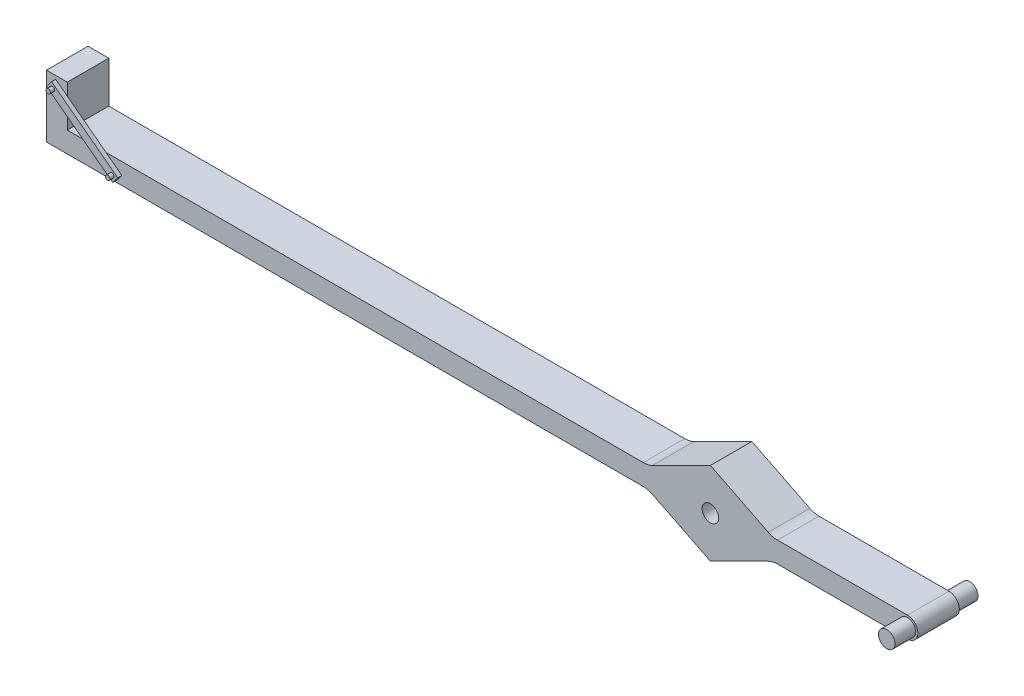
ISO-10303-21;
HEADER;
FILE_DESCRIPTION(('STEP AP214'),'2;1');
FILE_NAME('part.step','',(''),(''),'','','');
FILE_SCHEMA(('AUTOMOTIVE_DESIGN { 1 0 10303 214 1 1 1 1 }'));
ENDSEC;
DATA;
#1=APPLICATION_CONTEXT('core data for automotive mechanical design processes');
#2=APPLICATION_PROTOCOL_DEFINITION('international standard','automotive_design',2000,#1);
#3=PRODUCT_CONTEXT('',#1,'mechanical');
#4=PRODUCT('Part','Part','',(#3));
#5=PRODUCT_RELATED_PRODUCT_CATEGORY('part','',(#4));
#6=PRODUCT_DEFINITION_FORMATION('','',#4);
#7=PRODUCT_DEFINITION_CONTEXT('part definition',#1,'design');
#8=PRODUCT_DEFINITION('design','',#6,#7);
#9=PRODUCT_DEFINITION_SHAPE('','',#8);
#10=(LENGTH_UNIT() NAMED_UNIT(*) SI_UNIT(.MILLI.,.METRE.));
#11=(NAMED_UNIT(*) PLANE_ANGLE_UNIT() SI_UNIT($,.RADIAN.));
#12=(NAMED_UNIT(*) SI_UNIT($,.STERADIAN.) SOLID_ANGLE_UNIT());
#13=UNCERTAINTY_MEASURE_WITH_UNIT(LENGTH_MEASURE(1.E-05),#10,'distance_accuracy_value','');
#14=(GEOMETRIC_REPRESENTATION_CONTEXT(3) GLOBAL_UNCERTAINTY_ASSIGNED_CONTEXT((#13)) GLOBAL_UNIT_ASSIGNED_CONTEXT((#10,
#11,#12)) REPRESENTATION_CONTEXT('',''));
#15=CARTESIAN_POINT('',(0.,0.,0.));
#16=DIRECTION('',(0.,0.,1.));
#17=DIRECTION('',(1.,0.,0.));
#18=AXIS2_PLACEMENT_3D('',#15,#16,#17);
#19=CARTESIAN_POINT('',(-160.,-2.50000000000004,5.));
#20=DIRECTION('',(0.,0.,1.));
#21=DIRECTION('',(1.,0.,0.));
#22=AXIS2_PLACEMENT_3D('',#19,#20,#21);
#23=PLANE('',#22);
#24=CARTESIAN_POINT('',(47.5,0.,5.));
#25=DIRECTION('',(0.,0.,1.));
#26=DIRECTION('',(1.,0.,0.));
#27=AXIS2_PLACEMENT_3D('',#24,#25,#26);
#28=CIRCLE('',#27,2.);
#29=CARTESIAN_POINT('',(49.5,0.,5.));
#30=VERTEX_POINT('',#29);
#31=EDGE_CURVE('E11',#30,#30,#28,.T.);
#32=ORIENTED_EDGE('',*,*,#31,.F.);
#33=EDGE_LOOP('',(#32));
#34=FACE_BOUND('',#33,.T.);
#35=CARTESIAN_POINT('',(0.,0.,5.));
#36=DIRECTION('',(0.,0.,1.));
#37=DIRECTION('',(1.,0.,0.));
#38=AXIS2_PLACEMENT_3D('',#35,#36,#37);
#39=CIRCLE('',#38,2.);
#40=CARTESIAN_POINT('',(2.,0.,5.));
#41=VERTEX_POINT('',#40);
#42=EDGE_CURVE('E265',#41,#41,#39,.T.);
#43=ORIENTED_EDGE('',*,*,#42,.F.);
#44=EDGE_LOOP('',(#43));
#45=FACE_BOUND('',#44,.T.);
#46=DIRECTION('',(0.604197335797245,0.79683472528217,0.));
#47=VECTOR('',#46,1.);
#48=CARTESIAN_POINT('',(-141.84738728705,-0.390268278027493,5.));
#49=LINE('',#48,#47);
#50=CARTESIAN_POINT('',(-143.055781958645,-1.98393772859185,5.));
#51=VERTEX_POINT('',#50);
#52=CARTESIAN_POINT('',(-141.84738728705,-0.390268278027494,5.));
#53=VERTEX_POINT('',#52);
#54=EDGE_CURVE('E53',#51,#53,#49,.T.);
#55=ORIENTED_EDGE('',*,*,#54,.F.);
#56=DIRECTION('',(0.79683472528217,-0.604197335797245,0.));
#57=VECTOR('',#56,1.);
#58=CARTESIAN_POINT('',(-143.055781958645,-1.98393772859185,5.));
#59=LINE('',#58,#57);
#60=CARTESIAN_POINT('',(-148.96934210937,2.5,5.));
#61=VERTEX_POINT('',#60);
#62=EDGE_CURVE('E240',#61,#51,#59,.T.);
#63=ORIENTED_EDGE('',*,*,#62,.F.);
#64=DIRECTION('',(-1.,0.,0.));
#65=VECTOR('',#64,1.);
#66=CARTESIAN_POINT('',(-160.,2.5,5.));
#67=LINE('',#66,#65);
#68=CARTESIAN_POINT('',(-155.,2.5,5.));
#69=VERTEX_POINT('',#68);
#70=EDGE_CURVE('E293',#61,#69,#67,.T.);
#71=ORIENTED_EDGE('',*,*,#70,.T.);
#72=DIRECTION('',(0.,-1.,0.));
#73=VECTOR('',#72,1.);
#74=CARTESIAN_POINT('',(-155.,2.5,5.));
#75=LINE('',#74,#73);
#76=CARTESIAN_POINT('',(-155.,7.07272670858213,5.));
#77=VERTEX_POINT('',#76);
#78=EDGE_CURVE('E200',#77,#69,#75,.T.);
#79=ORIENTED_EDGE('',*,*,#78,.F.);
#80=CARTESIAN_POINT('',(-158.992476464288,10.1000089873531,5.));
#81=VERTEX_POINT('',#80);
#82=EDGE_CURVE('E241',#81,#77,#59,.T.);
#83=ORIENTED_EDGE('',*,*,#82,.F.);
#84=DIRECTION('',(-0.604197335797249,-0.796834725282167,0.));
#85=VECTOR('',#84,1.);
#86=CARTESIAN_POINT('',(-158.992476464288,10.1000089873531,5.));
#87=LINE('',#86,#85);
#88=CARTESIAN_POINT('',(-157.784081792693,11.6936784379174,5.));
#89=VERTEX_POINT('',#88);
#90=EDGE_CURVE('E227',#89,#81,#87,.T.);
#91=ORIENTED_EDGE('',*,*,#90,.F.);
#92=DIRECTION('',(-0.79683472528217,0.604197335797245,0.));
#93=VECTOR('',#92,1.);
#94=CARTESIAN_POINT('',(-157.784081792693,11.6936784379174,5.));
#95=LINE('',#94,#93);
#96=CARTESIAN_POINT('',(-155.,9.58265748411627,5.));
#97=VERTEX_POINT('',#96);
#98=EDGE_CURVE('E193',#97,#89,#95,.T.);
#99=ORIENTED_EDGE('',*,*,#98,.F.);
#100=CARTESIAN_POINT('',(-155.,12.5,5.));
#101=VERTEX_POINT('',#100);
#102=EDGE_CURVE('E186',#101,#97,#75,.T.);
#103=ORIENTED_EDGE('',*,*,#102,.F.);
#104=DIRECTION('',(1.,0.,0.));
#105=VECTOR('',#104,1.);
#106=CARTESIAN_POINT('',(-160.,12.5,5.));
#107=LINE('',#106,#105);
#108=CARTESIAN_POINT('',(-160.,12.5,5.));
#109=VERTEX_POINT('',#108);
#110=EDGE_CURVE('E190',#109,#101,#107,.T.);
#111=ORIENTED_EDGE('',*,*,#110,.F.);
#112=DIRECTION('',(0.,-1.,0.));
#113=VECTOR('',#112,1.);
#114=CARTESIAN_POINT('',(-160.,2.5,5.));
#115=LINE('',#114,#113);
#116=CARTESIAN_POINT('',(-160.,-2.50000000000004,5.));
#117=VERTEX_POINT('',#116);
#118=EDGE_CURVE('E272',#109,#117,#115,.T.);
#119=ORIENTED_EDGE('',*,*,#118,.T.);
#120=DIRECTION('',(1.,0.,0.));
#121=VECTOR('',#120,1.);
#122=CARTESIAN_POINT('',(-160.,-2.50000000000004,5.));
#123=LINE('',#122,#121);
#124=CARTESIAN_POINT('',(-16.180339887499,-2.5,5.));
#125=VERTEX_POINT('',#124);
#126=EDGE_CURVE('E274',#117,#125,#123,.T.);
#127=ORIENTED_EDGE('',*,*,#126,.T.);
#128=CARTESIAN_POINT('',(-16.1803398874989,-7.50000000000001,5.));
#129=DIRECTION('',(0.,0.,1.));
#130=DIRECTION('',(1.,0.,0.));
#131=AXIS2_PLACEMENT_3D('',#128,#129,#130);
#132=CIRCLE('',#131,5.);
#133=CARTESIAN_POINT('',(-13.9442719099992,-3.02786404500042,5.));
#134=VERTEX_POINT('',#133);
#135=EDGE_CURVE('E360',#125,#134,#132,.F.);
#136=ORIENTED_EDGE('',*,*,#135,.T.);
#137=DIRECTION('',(0.894427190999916,-0.447213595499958,0.));
#138=VECTOR('',#137,1.);
#139=CARTESIAN_POINT('',(-15.,-2.5,5.));
#140=LINE('',#139,#138);
#141=CARTESIAN_POINT('',(0.,-10.,5.));
#142=VERTEX_POINT('',#141);
#143=EDGE_CURVE('E278',#134,#142,#140,.T.);
#144=ORIENTED_EDGE('',*,*,#143,.T.);
#145=DIRECTION('',(0.894427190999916,0.447213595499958,0.));
#146=VECTOR('',#145,1.);
#147=CARTESIAN_POINT('',(0.,-10.,5.));
#148=LINE('',#147,#146);
#149=CARTESIAN_POINT('',(13.9442719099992,-3.02786404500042,5.));
#150=VERTEX_POINT('',#149);
#151=EDGE_CURVE('E280',#142,#150,#148,.T.);
#152=ORIENTED_EDGE('',*,*,#151,.T.);
#153=CARTESIAN_POINT('',(16.180339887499,-7.5,5.));
#154=DIRECTION('',(0.,0.,1.));
#155=DIRECTION('',(1.,0.,0.));
#156=AXIS2_PLACEMENT_3D('',#153,#154,#155);
#157=CIRCLE('',#156,5.);
#158=CARTESIAN_POINT('',(16.180339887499,-2.5,5.));
#159=VERTEX_POINT('',#158);
#160=EDGE_CURVE('E356',#150,#159,#157,.F.);
#161=ORIENTED_EDGE('',*,*,#160,.T.);
#162=DIRECTION('',(1.,0.,0.));
#163=VECTOR('',#162,1.);
#164=CARTESIAN_POINT('',(15.,-2.5,5.));
#165=LINE('',#164,#163);
#166=CARTESIAN_POINT('',(47.5,-2.49999999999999,5.));
#167=VERTEX_POINT('',#166);
#168=EDGE_CURVE('E283',#159,#167,#165,.T.);
#169=ORIENTED_EDGE('',*,*,#168,.T.);
#170=CARTESIAN_POINT('',(47.5,0.,5.));
#171=DIRECTION('',(0.,0.,1.));
#172=DIRECTION('',(1.,0.,0.));
#173=AXIS2_PLACEMENT_3D('',#170,#171,#172);
#174=CIRCLE('',#173,2.49999999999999);
#175=CARTESIAN_POINT('',(47.5,2.5,5.));
#176=VERTEX_POINT('',#175);
#177=EDGE_CURVE('E372',#167,#176,#174,.T.);
#178=ORIENTED_EDGE('',*,*,#177,.T.);
#179=DIRECTION('',(-1.,0.,0.));
#180=VECTOR('',#179,1.);
#181=CARTESIAN_POINT('',(15.,2.5,5.));
#182=LINE('',#181,#180);
#183=CARTESIAN_POINT('',(16.1803398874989,2.5,5.));
#184=VERTEX_POINT('',#183);
#185=EDGE_CURVE('E286',#176,#184,#182,.T.);
#186=ORIENTED_EDGE('',*,*,#185,.T.);
#187=CARTESIAN_POINT('',(16.1803398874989,7.5,5.));
#188=DIRECTION('',(0.,0.,1.));
#189=DIRECTION('',(1.,0.,0.));
#190=AXIS2_PLACEMENT_3D('',#187,#188,#189);
#191=CIRCLE('',#190,5.);
#192=CARTESIAN_POINT('',(13.9442719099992,3.02786404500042,5.));
#193=VERTEX_POINT('',#192);
#194=EDGE_CURVE('E352',#184,#193,#191,.F.);
#195=ORIENTED_EDGE('',*,*,#194,.T.);
#196=DIRECTION('',(-0.894427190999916,0.447213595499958,0.));
#197=VECTOR('',#196,1.);
#198=CARTESIAN_POINT('',(0.,10.,5.));
#199=LINE('',#198,#197);
#200=CARTESIAN_POINT('',(0.,10.,5.));
#201=VERTEX_POINT('',#200);
#202=EDGE_CURVE('E288',#193,#201,#199,.T.);
#203=ORIENTED_EDGE('',*,*,#202,.T.);
#204=DIRECTION('',(-0.894427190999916,-0.447213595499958,0.));
#205=VECTOR('',#204,1.);
#206=CARTESIAN_POINT('',(-15.,2.5,5.));
#207=LINE('',#206,#205);
#208=CARTESIAN_POINT('',(-13.9442719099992,3.02786404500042,5.));
#209=VERTEX_POINT('',#208);
#210=EDGE_CURVE('E290',#201,#209,#207,.T.);
#211=ORIENTED_EDGE('',*,*,#210,.T.);
#212=CARTESIAN_POINT('',(-16.180339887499,7.5,5.));
#213=DIRECTION('',(0.,0.,1.));
#214=DIRECTION('',(1.,0.,0.));
#215=AXIS2_PLACEMENT_3D('',#212,#213,#214);
#216=CIRCLE('',#215,5.);
#217=CARTESIAN_POINT('',(-16.180339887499,2.5,5.));
#218=VERTEX_POINT('',#217);
#219=EDGE_CURVE('E364',#209,#218,#216,.F.);
#220=ORIENTED_EDGE('',*,*,#219,.T.);
#221=CARTESIAN_POINT('',(-145.659165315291,2.5,5.));
#222=VERTEX_POINT('',#221);
#223=EDGE_CURVE('E294',#218,#222,#67,.T.);
#224=ORIENTED_EDGE('',*,*,#223,.T.);
#225=DIRECTION('',(-0.79683472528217,0.604197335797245,0.));
#226=VECTOR('',#225,1.);
#227=CARTESIAN_POINT('',(-157.784081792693,11.6936784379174,5.));
#228=LINE('',#227,#226);
#229=EDGE_CURVE('E58',#53,#222,#228,.T.);
#230=ORIENTED_EDGE('',*,*,#229,.F.);
#231=EDGE_LOOP('',(#55,#63,#71,#79,#83,#91,#99,#103,#111,#119,#127,#136,#144,#152,#161,#169,
#178,#186,#195,#203,#211,#220,#224,#230));
#232=FACE_BOUND('',#231,.T.);
#233=ADVANCED_FACE('F36',(#34,#45,#232),#23,.T.);
#234=CARTESIAN_POINT('',(47.5,0.,5.));
#235=DIRECTION('',(0.,0.,-1.));
#236=DIRECTION('',(-1.,0.,0.));
#237=AXIS2_PLACEMENT_3D('',#234,#235,#236);
#238=CYLINDRICAL_SURFACE('',#237,2.49999999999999);
#239=DIRECTION('',(0.,0.,-1.));
#240=VECTOR('',#239,1.);
#241=CARTESIAN_POINT('',(47.5,2.5,5.));
#242=LINE('',#241,#240);
#243=CARTESIAN_POINT('',(47.5,2.5,-5.));
#244=VERTEX_POINT('',#243);
#245=EDGE_CURVE('E366',#176,#244,#242,.T.);
#246=ORIENTED_EDGE('',*,*,#245,.F.);
#247=ORIENTED_EDGE('',*,*,#177,.F.);
#248=DIRECTION('',(0.,0.,-1.));
#249=VECTOR('',#248,1.);
#250=CARTESIAN_POINT('',(47.5,-2.49999999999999,5.));
#251=LINE('',#250,#249);
#252=CARTESIAN_POINT('',(47.5,-2.49999999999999,-5.));
#253=VERTEX_POINT('',#252);
#254=EDGE_CURVE('E369',#253,#167,#251,.F.);
#255=ORIENTED_EDGE('',*,*,#254,.F.);
#256=CARTESIAN_POINT('',(47.5,0.,-5.));
#257=DIRECTION('',(0.,0.,1.));
#258=DIRECTION('',(1.,0.,0.));
#259=AXIS2_PLACEMENT_3D('',#256,#257,#258);
#260=CIRCLE('',#259,2.49999999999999);
#261=EDGE_CURVE('E45',#244,#253,#260,.F.);
#262=ORIENTED_EDGE('',*,*,#261,.F.);
#263=EDGE_LOOP('',(#246,#247,#255,#262));
#264=FACE_BOUND('',#263,.T.);
#265=ADVANCED_FACE('F38',(#264),#238,.T.);
#266=CARTESIAN_POINT('',(-160.,-2.50000000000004,-5.));
#267=DIRECTION('',(0.,0.,1.));
#268=DIRECTION('',(1.,0.,0.));
#269=AXIS2_PLACEMENT_3D('',#266,#267,#268);
#270=PLANE('',#269);
#271=CARTESIAN_POINT('',(47.5,0.,-5.));
#272=DIRECTION('',(0.,0.,1.));
#273=DIRECTION('',(1.,0.,0.));
#274=AXIS2_PLACEMENT_3D('',#271,#272,#273);
#275=CIRCLE('',#274,2.);
#276=CARTESIAN_POINT('',(49.5,0.,-5.));
#277=VERTEX_POINT('',#276);
#278=EDGE_CURVE('E40',#277,#277,#275,.T.);
#279=ORIENTED_EDGE('',*,*,#278,.T.);
#280=EDGE_LOOP('',(#279));
#281=FACE_BOUND('',#280,.T.);
#282=DIRECTION('',(-1.,0.,0.));
#283=VECTOR('',#282,1.);
#284=CARTESIAN_POINT('',(15.,2.5,-5.));
#285=LINE('',#284,#283);
#286=CARTESIAN_POINT('',(16.1803398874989,2.5,-5.));
#287=VERTEX_POINT('',#286);
#288=EDGE_CURVE('E311',#244,#287,#285,.T.);
#289=ORIENTED_EDGE('',*,*,#288,.F.);
#290=ORIENTED_EDGE('',*,*,#261,.T.);
#291=DIRECTION('',(1.,0.,0.));
#292=VECTOR('',#291,1.);
#293=CARTESIAN_POINT('',(15.,-2.5,-5.));
#294=LINE('',#293,#292);
#295=CARTESIAN_POINT('',(16.180339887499,-2.5,-5.));
#296=VERTEX_POINT('',#295);
#297=EDGE_CURVE('E308',#296,#253,#294,.T.);
#298=ORIENTED_EDGE('',*,*,#297,.F.);
#299=CARTESIAN_POINT('',(16.180339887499,-7.5,-5.));
#300=DIRECTION('',(0.,0.,1.));
#301=DIRECTION('',(1.,0.,0.));
#302=AXIS2_PLACEMENT_3D('',#299,#300,#301);
#303=CIRCLE('',#302,5.);
#304=CARTESIAN_POINT('',(13.9442719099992,-3.02786404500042,-5.));
#305=VERTEX_POINT('',#304);
#306=EDGE_CURVE('E354',#296,#305,#303,.T.);
#307=ORIENTED_EDGE('',*,*,#306,.T.);
#308=DIRECTION('',(0.894427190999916,0.447213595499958,0.));
#309=VECTOR('',#308,1.);
#310=CARTESIAN_POINT('',(0.,-10.,-5.));
#311=LINE('',#310,#309);
#312=CARTESIAN_POINT('',(0.,-10.,-5.));
#313=VERTEX_POINT('',#312);
#314=EDGE_CURVE('E305',#313,#305,#311,.T.);
#315=ORIENTED_EDGE('',*,*,#314,.F.);
#316=DIRECTION('',(0.894427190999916,-0.447213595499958,0.));
#317=VECTOR('',#316,1.);
#318=CARTESIAN_POINT('',(-15.,-2.5,-5.));
#319=LINE('',#318,#317);
#320=CARTESIAN_POINT('',(-13.9442719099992,-3.02786404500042,-5.));
#321=VERTEX_POINT('',#320);
#322=EDGE_CURVE('E303',#321,#313,#319,.T.);
#323=ORIENTED_EDGE('',*,*,#322,.F.);
#324=CARTESIAN_POINT('',(-16.1803398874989,-7.50000000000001,-5.));
#325=DIRECTION('',(0.,0.,1.));
#326=DIRECTION('',(1.,0.,0.));
#327=AXIS2_PLACEMENT_3D('',#324,#325,#326);
#328=CIRCLE('',#327,5.);
#329=CARTESIAN_POINT('',(-16.180339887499,-2.5,-5.));
#330=VERTEX_POINT('',#329);
#331=EDGE_CURVE('E358',#321,#330,#328,.T.);
#332=ORIENTED_EDGE('',*,*,#331,.T.);
#333=DIRECTION('',(1.,0.,0.));
#334=VECTOR('',#333,1.);
#335=CARTESIAN_POINT('',(-160.,-2.50000000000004,-5.));
#336=LINE('',#335,#334);
#337=CARTESIAN_POINT('',(-160.,-2.50000000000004,-5.));
#338=VERTEX_POINT('',#337);
#339=EDGE_CURVE('E300',#338,#330,#336,.T.);
#340=ORIENTED_EDGE('',*,*,#339,.F.);
#341=DIRECTION('',(0.,-1.,0.));
#342=VECTOR('',#341,1.);
#343=CARTESIAN_POINT('',(-160.,2.5,-5.));
#344=LINE('',#343,#342);
#345=CARTESIAN_POINT('',(-160.,12.5,-5.));
#346=VERTEX_POINT('',#345);
#347=EDGE_CURVE('E268',#346,#338,#344,.T.);
#348=ORIENTED_EDGE('',*,*,#347,.F.);
#349=DIRECTION('',(1.,0.,0.));
#350=VECTOR('',#349,1.);
#351=CARTESIAN_POINT('',(-160.,12.5,-5.));
#352=LINE('',#351,#350);
#353=CARTESIAN_POINT('',(-155.,12.5,-5.));
#354=VERTEX_POINT('',#353);
#355=EDGE_CURVE('E214',#346,#354,#352,.T.);
#356=ORIENTED_EDGE('',*,*,#355,.T.);
#357=DIRECTION('',(0.,-1.,0.));
#358=VECTOR('',#357,1.);
#359=CARTESIAN_POINT('',(-155.,2.5,-5.));
#360=LINE('',#359,#358);
#361=CARTESIAN_POINT('',(-155.,2.5,-5.));
#362=VERTEX_POINT('',#361);
#363=EDGE_CURVE('E205',#354,#362,#360,.T.);
#364=ORIENTED_EDGE('',*,*,#363,.T.);
#365=DIRECTION('',(-1.,0.,0.));
#366=VECTOR('',#365,1.);
#367=CARTESIAN_POINT('',(-160.,2.5,-5.));
#368=LINE('',#367,#366);
#369=CARTESIAN_POINT('',(-16.180339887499,2.5,-5.));
#370=VERTEX_POINT('',#369);
#371=EDGE_CURVE('E275',#370,#362,#368,.T.);
#372=ORIENTED_EDGE('',*,*,#371,.F.);
#373=CARTESIAN_POINT('',(-16.180339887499,7.5,-5.));
#374=DIRECTION('',(0.,0.,1.));
#375=DIRECTION('',(1.,0.,0.));
#376=AXIS2_PLACEMENT_3D('',#373,#374,#375);
#377=CIRCLE('',#376,5.);
#378=CARTESIAN_POINT('',(-13.9442719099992,3.02786404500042,-5.));
#379=VERTEX_POINT('',#378);
#380=EDGE_CURVE('E362',#370,#379,#377,.T.);
#381=ORIENTED_EDGE('',*,*,#380,.T.);
#382=DIRECTION('',(-0.894427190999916,-0.447213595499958,0.));
#383=VECTOR('',#382,1.);
#384=CARTESIAN_POINT('',(-15.,2.5,-5.));
#385=LINE('',#384,#383);
#386=CARTESIAN_POINT('',(0.,10.,-5.));
#387=VERTEX_POINT('',#386);
#388=EDGE_CURVE('E315',#387,#379,#385,.T.);
#389=ORIENTED_EDGE('',*,*,#388,.F.);
#390=DIRECTION('',(-0.894427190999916,0.447213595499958,0.));
#391=VECTOR('',#390,1.);
#392=CARTESIAN_POINT('',(0.,10.,-5.));
#393=LINE('',#392,#391);
#394=CARTESIAN_POINT('',(13.9442719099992,3.02786404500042,-5.));
#395=VERTEX_POINT('',#394);
#396=EDGE_CURVE('E313',#395,#387,#393,.T.);
#397=ORIENTED_EDGE('',*,*,#396,.F.);
#398=CARTESIAN_POINT('',(16.1803398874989,7.5,-5.));
#399=DIRECTION('',(0.,0.,1.));
#400=DIRECTION('',(1.,0.,0.));
#401=AXIS2_PLACEMENT_3D('',#398,#399,#400);
#402=CIRCLE('',#401,5.);
#403=EDGE_CURVE('E349',#395,#287,#402,.T.);
#404=ORIENTED_EDGE('',*,*,#403,.T.);
#405=EDGE_LOOP('',(#289,#290,#298,#307,#315,#323,#332,#340,#348,#356,#364,#372,#381,#389,#397,#404));
#406=FACE_BOUND('',#405,.T.);
#407=CARTESIAN_POINT('',(0.,0.,-5.));
#408=DIRECTION('',(0.,0.,1.));
#409=DIRECTION('',(1.,0.,0.));
#410=AXIS2_PLACEMENT_3D('',#407,#408,#409);
#411=CIRCLE('',#410,2.);
#412=CARTESIAN_POINT('',(2.,0.,-5.));
#413=VERTEX_POINT('',#412);
#414=EDGE_CURVE('E269',#413,#413,#411,.T.);
#415=ORIENTED_EDGE('',*,*,#414,.T.);
#416=EDGE_LOOP('',(#415));
#417=FACE_BOUND('',#416,.T.);
#418=ADVANCED_FACE('F377',(#281,#406,#417),#270,.F.);
#419=CARTESIAN_POINT('',(-160.,2.5,5.));
#420=DIRECTION('',(1.,0.,0.));
#421=DIRECTION('',(0.,0.,-1.));
#422=AXIS2_PLACEMENT_3D('',#419,#420,#421);
#423=PLANE('',#422);
#424=ORIENTED_EDGE('',*,*,#347,.T.);
#425=DIRECTION('',(0.,0.,-1.));
#426=VECTOR('',#425,1.);
#427=CARTESIAN_POINT('',(-160.,-2.50000000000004,5.));
#428=LINE('',#427,#426);
#429=EDGE_CURVE('E325',#117,#338,#428,.T.);
#430=ORIENTED_EDGE('',*,*,#429,.F.);
#431=ORIENTED_EDGE('',*,*,#118,.F.);
#432=DIRECTION('',(0.,0.,-1.));
#433=VECTOR('',#432,1.);
#434=CARTESIAN_POINT('',(-160.,12.5,16.180339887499));
#435=LINE('',#434,#433);
#436=EDGE_CURVE('E212',#109,#346,#435,.T.);
#437=ORIENTED_EDGE('',*,*,#436,.T.);
#438=EDGE_LOOP('',(#424,#430,#431,#437));
#439=FACE_BOUND('',#438,.T.);
#440=ADVANCED_FACE('F407',(#439),#423,.F.);
#441=CARTESIAN_POINT('',(-160.,-2.50000000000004,5.));
#442=DIRECTION('',(0.,1.,0.));
#443=DIRECTION('',(-1.,0.,0.));
#444=AXIS2_PLACEMENT_3D('',#441,#442,#443);
#445=PLANE('',#444);
#446=ORIENTED_EDGE('',*,*,#339,.T.);
#447=DIRECTION('',(0.,0.,-1.));
#448=VECTOR('',#447,1.);
#449=CARTESIAN_POINT('',(-16.1803398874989,-2.5,5.));
#450=LINE('',#449,#448);
#451=EDGE_CURVE('E342',#330,#125,#450,.F.);
#452=ORIENTED_EDGE('',*,*,#451,.T.);
#453=ORIENTED_EDGE('',*,*,#126,.F.);
#454=ORIENTED_EDGE('',*,*,#429,.T.);
#455=EDGE_LOOP('',(#446,#452,#453,#454));
#456=FACE_BOUND('',#455,.T.);
#457=ADVANCED_FACE('F402',(#456),#445,.F.);
#458=CARTESIAN_POINT('',(-15.,-2.5,5.));
#459=DIRECTION('',(0.447213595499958,0.894427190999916,0.));
#460=DIRECTION('',(-0.894427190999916,0.447213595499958,0.));
#461=AXIS2_PLACEMENT_3D('',#458,#459,#460);
#462=PLANE('',#461);
#463=ORIENTED_EDGE('',*,*,#143,.F.);
#464=DIRECTION('',(0.,0.,-1.));
#465=VECTOR('',#464,1.);
#466=CARTESIAN_POINT('',(-13.9442719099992,-3.02786404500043,-5.));
#467=LINE('',#466,#465);
#468=EDGE_CURVE('E339',#134,#321,#467,.T.);
#469=ORIENTED_EDGE('',*,*,#468,.T.);
#470=ORIENTED_EDGE('',*,*,#322,.T.);
#471=DIRECTION('',(0.,0.,-1.));
#472=VECTOR('',#471,1.);
#473=CARTESIAN_POINT('',(0.,-10.,5.));
#474=LINE('',#473,#472);
#475=EDGE_CURVE('E322',#142,#313,#474,.T.);
#476=ORIENTED_EDGE('',*,*,#475,.F.);
#477=EDGE_LOOP('',(#463,#469,#470,#476));
#478=FACE_BOUND('',#477,.T.);
#479=ADVANCED_FACE('F397',(#478),#462,.F.);
#480=CARTESIAN_POINT('',(0.,-10.,5.));
#481=DIRECTION('',(-0.447213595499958,0.894427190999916,0.));
#482=DIRECTION('',(-0.894427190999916,-0.447213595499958,0.));
#483=AXIS2_PLACEMENT_3D('',#480,#481,#482);
#484=PLANE('',#483);
#485=ORIENTED_EDGE('',*,*,#314,.T.);
#486=DIRECTION('',(0.,0.,-1.));
#487=VECTOR('',#486,1.);
#488=CARTESIAN_POINT('',(13.9442719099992,-3.02786404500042,5.));
#489=LINE('',#488,#487);
#490=EDGE_CURVE('E337',#305,#150,#489,.F.);
#491=ORIENTED_EDGE('',*,*,#490,.T.);
#492=ORIENTED_EDGE('',*,*,#151,.F.);
#493=ORIENTED_EDGE('',*,*,#475,.T.);
#494=EDGE_LOOP('',(#485,#491,#492,#493));
#495=FACE_BOUND('',#494,.T.);
#496=ADVANCED_FACE('F392',(#495),#484,.F.);
#497=CARTESIAN_POINT('',(15.,-2.5,5.));
#498=DIRECTION('',(0.,1.,0.));
#499=DIRECTION('',(-1.,0.,0.));
#500=AXIS2_PLACEMENT_3D('',#497,#498,#499);
#501=PLANE('',#500);
#502=ORIENTED_EDGE('',*,*,#297,.T.);
#503=ORIENTED_EDGE('',*,*,#254,.T.);
#504=ORIENTED_EDGE('',*,*,#168,.F.);
#505=DIRECTION('',(0.,0.,-1.));
#506=VECTOR('',#505,1.);
#507=CARTESIAN_POINT('',(16.180339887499,-2.5,-5.));
#508=LINE('',#507,#506);
#509=EDGE_CURVE('E334',#159,#296,#508,.T.);
#510=ORIENTED_EDGE('',*,*,#509,.T.);
#511=EDGE_LOOP('',(#502,#503,#504,#510));
#512=FACE_BOUND('',#511,.T.);
#513=ADVANCED_FACE('F383',(#512),#501,.F.);
#514=CARTESIAN_POINT('',(15.,2.5,5.));
#515=DIRECTION('',(0.,-1.,0.));
#516=DIRECTION('',(1.,0.,0.));
#517=AXIS2_PLACEMENT_3D('',#514,#515,#516);
#518=PLANE('',#517);
#519=ORIENTED_EDGE('',*,*,#185,.F.);
#520=ORIENTED_EDGE('',*,*,#245,.T.);
#521=ORIENTED_EDGE('',*,*,#288,.T.);
#522=DIRECTION('',(0.,0.,-1.));
#523=VECTOR('',#522,1.);
#524=CARTESIAN_POINT('',(16.1803398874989,2.5,5.));
#525=LINE('',#524,#523);
#526=EDGE_CURVE('E331',#287,#184,#525,.F.);
#527=ORIENTED_EDGE('',*,*,#526,.T.);
#528=EDGE_LOOP('',(#519,#520,#521,#527));
#529=FACE_BOUND('',#528,.T.);
#530=ADVANCED_FACE('F473',(#529),#518,.F.);
#531=CARTESIAN_POINT('',(0.,10.,5.));
#532=DIRECTION('',(-0.447213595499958,-0.894427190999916,0.));
#533=DIRECTION('',(0.894427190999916,-0.447213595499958,0.));
#534=AXIS2_PLACEMENT_3D('',#531,#532,#533);
#535=PLANE('',#534);
#536=ORIENTED_EDGE('',*,*,#202,.F.);
#537=DIRECTION('',(0.,0.,-1.));
#538=VECTOR('',#537,1.);
#539=CARTESIAN_POINT('',(13.9442719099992,3.02786404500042,-5.));
#540=LINE('',#539,#538);
#541=EDGE_CURVE('E328',#193,#395,#540,.T.);
#542=ORIENTED_EDGE('',*,*,#541,.T.);
#543=ORIENTED_EDGE('',*,*,#396,.T.);
#544=DIRECTION('',(0.,0.,-1.));
#545=VECTOR('',#544,1.);
#546=CARTESIAN_POINT('',(0.,10.,5.));
#547=LINE('',#546,#545);
#548=EDGE_CURVE('E296',#201,#387,#547,.T.);
#549=ORIENTED_EDGE('',*,*,#548,.F.);
#550=EDGE_LOOP('',(#536,#542,#543,#549));
#551=FACE_BOUND('',#550,.T.);
#552=ADVANCED_FACE('F469',(#551),#535,.F.);
#553=CARTESIAN_POINT('',(-15.,2.5,5.));
#554=DIRECTION('',(0.447213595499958,-0.894427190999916,0.));
#555=DIRECTION('',(0.894427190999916,0.447213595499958,0.));
#556=AXIS2_PLACEMENT_3D('',#553,#554,#555);
#557=PLANE('',#556);
#558=ORIENTED_EDGE('',*,*,#388,.T.);
#559=DIRECTION('',(0.,0.,-1.));
#560=VECTOR('',#559,1.);
#561=CARTESIAN_POINT('',(-13.9442719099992,3.02786404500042,5.));
#562=LINE('',#561,#560);
#563=EDGE_CURVE('E347',#379,#209,#562,.F.);
#564=ORIENTED_EDGE('',*,*,#563,.T.);
#565=ORIENTED_EDGE('',*,*,#210,.F.);
#566=ORIENTED_EDGE('',*,*,#548,.T.);
#567=EDGE_LOOP('',(#558,#564,#565,#566));
#568=FACE_BOUND('',#567,.T.);
#569=ADVANCED_FACE('F465',(#568),#557,.F.);
#570=CARTESIAN_POINT('',(-160.,2.5,5.));
#571=DIRECTION('',(0.,-1.,0.));
#572=DIRECTION('',(1.,0.,0.));
#573=AXIS2_PLACEMENT_3D('',#570,#571,#572);
#574=PLANE('',#573);
#575=ORIENTED_EDGE('',*,*,#371,.T.);
#576=DIRECTION('',(0.,0.,-1.));
#577=VECTOR('',#576,1.);
#578=CARTESIAN_POINT('',(-155.,2.5,16.180339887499));
#579=LINE('',#578,#577);
#580=EDGE_CURVE('E197',#69,#362,#579,.T.);
#581=ORIENTED_EDGE('',*,*,#580,.F.);
#582=ORIENTED_EDGE('',*,*,#70,.F.);
#583=EDGE_CURVE('E297',#222,#61,#67,.T.);
#584=ORIENTED_EDGE('',*,*,#583,.F.);
#585=ORIENTED_EDGE('',*,*,#223,.F.);
#586=DIRECTION('',(0.,0.,-1.));
#587=VECTOR('',#586,1.);
#588=CARTESIAN_POINT('',(-16.180339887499,2.5,-5.));
#589=LINE('',#588,#587);
#590=EDGE_CURVE('E344',#218,#370,#589,.T.);
#591=ORIENTED_EDGE('',*,*,#590,.T.);
#592=EDGE_LOOP('',(#575,#581,#582,#584,#585,#591));
#593=FACE_BOUND('',#592,.T.);
#594=ADVANCED_FACE('F462',(#593),#574,.F.);
#595=CARTESIAN_POINT('',(0.,0.,5.));
#596=DIRECTION('',(0.,0.,-1.));
#597=DIRECTION('',(-1.,0.,0.));
#598=AXIS2_PLACEMENT_3D('',#595,#596,#597);
#599=CYLINDRICAL_SURFACE('',#598,2.);
#600=ORIENTED_EDGE('',*,*,#42,.T.);
#601=EDGE_LOOP('',(#600));
#602=FACE_BOUND('',#601,.T.);
#603=ORIENTED_EDGE('',*,*,#414,.F.);
#604=EDGE_LOOP('',(#603));
#605=FACE_BOUND('',#604,.T.);
#606=ADVANCED_FACE('F457',(#602,#605),#599,.F.);
#607=CARTESIAN_POINT('',(16.1803398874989,7.5,5.));
#608=DIRECTION('',(0.,0.,1.));
#609=DIRECTION('',(1.,0.,0.));
#610=AXIS2_PLACEMENT_3D('',#607,#608,#609);
#611=CYLINDRICAL_SURFACE('',#610,5.);
#612=ORIENTED_EDGE('',*,*,#194,.F.);
#613=ORIENTED_EDGE('',*,*,#526,.F.);
#614=ORIENTED_EDGE('',*,*,#403,.F.);
#615=ORIENTED_EDGE('',*,*,#541,.F.);
#616=EDGE_LOOP('',(#612,#613,#614,#615));
#617=FACE_BOUND('',#616,.T.);
#618=ADVANCED_FACE('F488',(#617),#611,.F.);
#619=CARTESIAN_POINT('',(16.180339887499,-7.5,5.));
#620=DIRECTION('',(0.,0.,1.));
#621=DIRECTION('',(1.,0.,0.));
#622=AXIS2_PLACEMENT_3D('',#619,#620,#621);
#623=CYLINDRICAL_SURFACE('',#622,5.);
#624=ORIENTED_EDGE('',*,*,#160,.F.);
#625=ORIENTED_EDGE('',*,*,#490,.F.);
#626=ORIENTED_EDGE('',*,*,#306,.F.);
#627=ORIENTED_EDGE('',*,*,#509,.F.);
#628=EDGE_LOOP('',(#624,#625,#626,#627));
#629=FACE_BOUND('',#628,.T.);
#630=ADVANCED_FACE('F387',(#629),#623,.F.);
#631=CARTESIAN_POINT('',(-16.1803398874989,-7.50000000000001,5.));
#632=DIRECTION('',(0.,0.,1.));
#633=DIRECTION('',(1.,0.,0.));
#634=AXIS2_PLACEMENT_3D('',#631,#632,#633);
#635=CYLINDRICAL_SURFACE('',#634,5.);
#636=ORIENTED_EDGE('',*,*,#135,.F.);
#637=ORIENTED_EDGE('',*,*,#451,.F.);
#638=ORIENTED_EDGE('',*,*,#331,.F.);
#639=ORIENTED_EDGE('',*,*,#468,.F.);
#640=EDGE_LOOP('',(#636,#637,#638,#639));
#641=FACE_BOUND('',#640,.T.);
#642=ADVANCED_FACE('F405',(#641),#635,.F.);
#643=CARTESIAN_POINT('',(-16.180339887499,7.5,5.));
#644=DIRECTION('',(0.,0.,1.));
#645=DIRECTION('',(1.,0.,0.));
#646=AXIS2_PLACEMENT_3D('',#643,#644,#645);
#647=CYLINDRICAL_SURFACE('',#646,5.);
#648=ORIENTED_EDGE('',*,*,#219,.F.);
#649=ORIENTED_EDGE('',*,*,#563,.F.);
#650=ORIENTED_EDGE('',*,*,#380,.F.);
#651=ORIENTED_EDGE('',*,*,#590,.F.);
#652=EDGE_LOOP('',(#648,#649,#650,#651));
#653=FACE_BOUND('',#652,.T.);
#654=ADVANCED_FACE('F495',(#653),#647,.F.);
#655=CARTESIAN_POINT('',(47.5,0.,-10.));
#656=DIRECTION('',(0.,0.,1.));
#657=DIRECTION('',(1.,0.,0.));
#658=AXIS2_PLACEMENT_3D('',#655,#656,#657);
#659=PLANE('',#658);
#660=CARTESIAN_POINT('',(47.5,0.,-10.));
#661=DIRECTION('',(0.,0.,1.));
#662=DIRECTION('',(1.,0.,0.));
#663=AXIS2_PLACEMENT_3D('',#660,#661,#662);
#664=CIRCLE('',#663,2.);
#665=CARTESIAN_POINT('',(49.5,0.,-10.));
#666=VERTEX_POINT('',#665);
#667=EDGE_CURVE('E262',#666,#666,#664,.T.);
#668=ORIENTED_EDGE('',*,*,#667,.F.);
#669=EDGE_LOOP('',(#668));
#670=FACE_BOUND('',#669,.T.);
#671=ADVANCED_FACE('F497',(#670),#659,.F.);
#672=CARTESIAN_POINT('',(47.5,0.,-10.));
#673=DIRECTION('',(0.,0.,1.));
#674=DIRECTION('',(1.,0.,0.));
#675=AXIS2_PLACEMENT_3D('',#672,#673,#674);
#676=CYLINDRICAL_SURFACE('',#675,2.);
#677=ORIENTED_EDGE('',*,*,#667,.T.);
#678=EDGE_LOOP('',(#677));
#679=FACE_BOUND('',#678,.T.);
#680=ORIENTED_EDGE('',*,*,#278,.F.);
#681=EDGE_LOOP('',(#680));
#682=FACE_BOUND('',#681,.T.);
#683=ADVANCED_FACE('F502',(#679,#682),#676,.T.);
#684=ORIENTED_EDGE('',*,*,#31,.T.);
#685=EDGE_LOOP('',(#684));
#686=FACE_BOUND('',#685,.T.);
#687=CARTESIAN_POINT('',(47.5,0.,10.));
#688=DIRECTION('',(0.,0.,1.));
#689=DIRECTION('',(1.,0.,0.));
#690=AXIS2_PLACEMENT_3D('',#687,#688,#689);
#691=CIRCLE('',#690,2.);
#692=CARTESIAN_POINT('',(49.5,0.,10.));
#693=VERTEX_POINT('',#692);
#694=EDGE_CURVE('E259',#693,#693,#691,.T.);
#695=ORIENTED_EDGE('',*,*,#694,.F.);
#696=EDGE_LOOP('',(#695));
#697=FACE_BOUND('',#696,.T.);
#698=ADVANCED_FACE('F539',(#686,#697),#676,.T.);
#699=CARTESIAN_POINT('',(47.5,0.,10.));
#700=DIRECTION('',(0.,0.,1.));
#701=DIRECTION('',(1.,0.,0.));
#702=AXIS2_PLACEMENT_3D('',#699,#700,#701);
#703=PLANE('',#702);
#704=ORIENTED_EDGE('',*,*,#694,.T.);
#705=EDGE_LOOP('',(#704));
#706=FACE_BOUND('',#705,.T.);
#707=ADVANCED_FACE('F441',(#706),#703,.T.);
#708=CARTESIAN_POINT('',(-157.784081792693,11.6936784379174,5.));
#709=DIRECTION('',(0.,0.,-1.));
#710=DIRECTION('',(-1.,0.,0.));
#711=AXIS2_PLACEMENT_3D('',#708,#709,#710);
#712=PLANE('',#711);
#713=EDGE_CURVE('E198',#97,#77,#75,.T.);
#714=ORIENTED_EDGE('',*,*,#713,.F.);
#715=EDGE_CURVE('E246',#222,#97,#228,.T.);
#716=ORIENTED_EDGE('',*,*,#715,.F.);
#717=ORIENTED_EDGE('',*,*,#583,.T.);
#718=EDGE_CURVE('E244',#77,#61,#59,.T.);
#719=ORIENTED_EDGE('',*,*,#718,.F.);
#720=EDGE_LOOP('',(#714,#716,#717,#719));
#721=FACE_BOUND('',#720,.T.);
#722=ADVANCED_FACE('F431',(#721),#712,.T.);
#723=CARTESIAN_POINT('',(-157.784081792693,11.6936784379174,6.));
#724=DIRECTION('',(0.,0.,-1.));
#725=DIRECTION('',(-1.,0.,0.));
#726=AXIS2_PLACEMENT_3D('',#723,#724,#725);
#727=PLANE('',#726);
#728=CARTESIAN_POINT('',(-157.591444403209,10.292646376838,6.));
#729=DIRECTION('',(0.,0.,1.));
#730=DIRECTION('',(1.,0.,0.));
#731=AXIS2_PLACEMENT_3D('',#728,#729,#730);
#732=CIRCLE('',#731,0.535102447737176);
#733=CARTESIAN_POINT('',(-157.056341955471,10.292646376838,6.));
#734=VERTEX_POINT('',#733);
#735=EDGE_CURVE('E224',#734,#734,#732,.T.);
#736=ORIENTED_EDGE('',*,*,#735,.F.);
#737=EDGE_LOOP('',(#736));
#738=FACE_BOUND('',#737,.T.);
#739=DIRECTION('',(-0.604197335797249,-0.796834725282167,0.));
#740=VECTOR('',#739,1.);
#741=CARTESIAN_POINT('',(-158.992476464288,10.1000089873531,6.));
#742=LINE('',#741,#740);
#743=CARTESIAN_POINT('',(-157.784081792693,11.6936784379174,6.));
#744=VERTEX_POINT('',#743);
#745=CARTESIAN_POINT('',(-158.992476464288,10.1000089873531,6.));
#746=VERTEX_POINT('',#745);
#747=EDGE_CURVE('E228',#744,#746,#742,.T.);
#748=ORIENTED_EDGE('',*,*,#747,.T.);
#749=DIRECTION('',(0.79683472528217,-0.604197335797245,0.));
#750=VECTOR('',#749,1.);
#751=CARTESIAN_POINT('',(-143.055781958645,-1.98393772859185,6.));
#752=LINE('',#751,#750);
#753=CARTESIAN_POINT('',(-143.055781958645,-1.98393772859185,6.));
#754=VERTEX_POINT('',#753);
#755=EDGE_CURVE('E231',#746,#754,#752,.T.);
#756=ORIENTED_EDGE('',*,*,#755,.T.);
#757=DIRECTION('',(0.604197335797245,0.79683472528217,0.));
#758=VECTOR('',#757,1.);
#759=CARTESIAN_POINT('',(-141.84738728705,-0.390268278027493,6.));
#760=LINE('',#759,#758);
#761=CARTESIAN_POINT('',(-141.84738728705,-0.390268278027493,6.));
#762=VERTEX_POINT('',#761);
#763=EDGE_CURVE('E233',#754,#762,#760,.T.);
#764=ORIENTED_EDGE('',*,*,#763,.T.);
#765=DIRECTION('',(-0.79683472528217,0.604197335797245,0.));
#766=VECTOR('',#765,1.);
#767=CARTESIAN_POINT('',(-157.784081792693,11.6936784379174,6.));
#768=LINE('',#767,#766);
#769=EDGE_CURVE('E235',#762,#744,#768,.T.);
#770=ORIENTED_EDGE('',*,*,#769,.T.);
#771=EDGE_LOOP('',(#748,#756,#764,#770));
#772=FACE_BOUND('',#771,.T.);
#773=CARTESIAN_POINT('',(-143.248419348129,-0.582905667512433,6.));
#774=DIRECTION('',(0.,0.,1.));
#775=DIRECTION('',(1.,0.,0.));
#776=AXIS2_PLACEMENT_3D('',#773,#774,#775);
#777=CIRCLE('',#776,0.535102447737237);
#778=CARTESIAN_POINT('',(-142.713316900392,-0.582905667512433,6.));
#779=VERTEX_POINT('',#778);
#780=EDGE_CURVE('E221',#779,#779,#777,.T.);
#781=ORIENTED_EDGE('',*,*,#780,.F.);
#782=EDGE_LOOP('',(#781));
#783=FACE_BOUND('',#782,.T.);
#784=ADVANCED_FACE('F428',(#738,#772,#783),#727,.F.);
#785=CARTESIAN_POINT('',(-158.992476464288,10.1000089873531,6.));
#786=DIRECTION('',(0.796834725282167,-0.604197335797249,0.));
#787=DIRECTION('',(0.604197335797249,0.796834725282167,0.));
#788=AXIS2_PLACEMENT_3D('',#785,#786,#787);
#789=PLANE('',#788);
#790=ORIENTED_EDGE('',*,*,#90,.T.);
#791=DIRECTION('',(0.,0.,-1.));
#792=VECTOR('',#791,1.);
#793=CARTESIAN_POINT('',(-158.992476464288,10.1000089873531,6.));
#794=LINE('',#793,#792);
#795=EDGE_CURVE('E256',#746,#81,#794,.T.);
#796=ORIENTED_EDGE('',*,*,#795,.F.);
#797=ORIENTED_EDGE('',*,*,#747,.F.);
#798=DIRECTION('',(0.,0.,-1.));
#799=VECTOR('',#798,1.);
#800=CARTESIAN_POINT('',(-157.784081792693,11.6936784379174,6.));
#801=LINE('',#800,#799);
#802=EDGE_CURVE('E237',#744,#89,#801,.T.);
#803=ORIENTED_EDGE('',*,*,#802,.T.);
#804=EDGE_LOOP('',(#790,#796,#797,#803));
#805=FACE_BOUND('',#804,.T.);
#806=ADVANCED_FACE('F430',(#805),#789,.F.);
#807=CARTESIAN_POINT('',(-143.055781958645,-1.98393772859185,6.));
#808=DIRECTION('',(0.604197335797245,0.79683472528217,0.));
#809=DIRECTION('',(-0.79683472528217,0.604197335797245,0.));
#810=AXIS2_PLACEMENT_3D('',#807,#808,#809);
#811=PLANE('',#810);
#812=ORIENTED_EDGE('',*,*,#82,.T.);
#813=ORIENTED_EDGE('',*,*,#718,.T.);
#814=ORIENTED_EDGE('',*,*,#62,.T.);
#815=DIRECTION('',(0.,0.,-1.));
#816=VECTOR('',#815,1.);
#817=CARTESIAN_POINT('',(-143.055781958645,-1.98393772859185,6.));
#818=LINE('',#817,#816);
#819=EDGE_CURVE('E253',#754,#51,#818,.T.);
#820=ORIENTED_EDGE('',*,*,#819,.F.);
#821=ORIENTED_EDGE('',*,*,#755,.F.);
#822=ORIENTED_EDGE('',*,*,#795,.T.);
#823=EDGE_LOOP('',(#812,#813,#814,#820,#821,#822));
#824=FACE_BOUND('',#823,.T.);
#825=ADVANCED_FACE('F438',(#824),#811,.F.);
#826=CARTESIAN_POINT('',(-141.84738728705,-0.390268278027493,6.));
#827=DIRECTION('',(-0.79683472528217,0.604197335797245,0.));
#828=DIRECTION('',(-0.604197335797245,-0.79683472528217,0.));
#829=AXIS2_PLACEMENT_3D('',#826,#827,#828);
#830=PLANE('',#829);
#831=ORIENTED_EDGE('',*,*,#54,.T.);
#832=DIRECTION('',(0.,0.,-1.));
#833=VECTOR('',#832,1.);
#834=CARTESIAN_POINT('',(-141.84738728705,-0.390268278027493,6.));
#835=LINE('',#834,#833);
#836=EDGE_CURVE('E250',#762,#53,#835,.T.);
#837=ORIENTED_EDGE('',*,*,#836,.F.);
#838=ORIENTED_EDGE('',*,*,#763,.F.);
#839=ORIENTED_EDGE('',*,*,#819,.T.);
#840=EDGE_LOOP('',(#831,#837,#838,#839));
#841=FACE_BOUND('',#840,.T.);
#842=ADVANCED_FACE('F526',(#841),#830,.F.);
#843=CARTESIAN_POINT('',(-157.784081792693,11.6936784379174,6.));
#844=DIRECTION('',(-0.604197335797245,-0.79683472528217,0.));
#845=DIRECTION('',(0.79683472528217,-0.604197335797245,0.));
#846=AXIS2_PLACEMENT_3D('',#843,#844,#845);
#847=PLANE('',#846);
#848=ORIENTED_EDGE('',*,*,#229,.T.);
#849=ORIENTED_EDGE('',*,*,#715,.T.);
#850=ORIENTED_EDGE('',*,*,#98,.T.);
#851=ORIENTED_EDGE('',*,*,#802,.F.);
#852=ORIENTED_EDGE('',*,*,#769,.F.);
#853=ORIENTED_EDGE('',*,*,#836,.T.);
#854=EDGE_LOOP('',(#848,#849,#850,#851,#852,#853));
#855=FACE_BOUND('',#854,.T.);
#856=ADVANCED_FACE('F520',(#855),#847,.F.);
#857=CARTESIAN_POINT('',(-160.,12.5,16.180339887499));
#858=DIRECTION('',(0.,1.,0.));
#859=DIRECTION('',(-1.,0.,0.));
#860=AXIS2_PLACEMENT_3D('',#857,#858,#859);
#861=PLANE('',#860);
#862=ORIENTED_EDGE('',*,*,#436,.F.);
#863=ORIENTED_EDGE('',*,*,#110,.T.);
#864=DIRECTION('',(0.,0.,-1.));
#865=VECTOR('',#864,1.);
#866=CARTESIAN_POINT('',(-155.,12.5,16.180339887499));
#867=LINE('',#866,#865);
#868=EDGE_CURVE('E202',#101,#354,#867,.T.);
#869=ORIENTED_EDGE('',*,*,#868,.T.);
#870=ORIENTED_EDGE('',*,*,#355,.F.);
#871=EDGE_LOOP('',(#862,#863,#869,#870));
#872=FACE_BOUND('',#871,.T.);
#873=ADVANCED_FACE('F210',(#872),#861,.T.);
#874=CARTESIAN_POINT('',(-155.,2.5,16.180339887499));
#875=DIRECTION('',(1.,0.,0.));
#876=DIRECTION('',(0.,0.,-1.));
#877=AXIS2_PLACEMENT_3D('',#874,#875,#876);
#878=PLANE('',#877);
#879=ORIENTED_EDGE('',*,*,#868,.F.);
#880=ORIENTED_EDGE('',*,*,#102,.T.);
#881=ORIENTED_EDGE('',*,*,#713,.T.);
#882=ORIENTED_EDGE('',*,*,#78,.T.);
#883=ORIENTED_EDGE('',*,*,#580,.T.);
#884=ORIENTED_EDGE('',*,*,#363,.F.);
#885=EDGE_LOOP('',(#879,#880,#881,#882,#883,#884));
#886=FACE_BOUND('',#885,.T.);
#887=ADVANCED_FACE('F203',(#886),#878,.T.);
#888=CARTESIAN_POINT('',(-157.591444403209,10.292646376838,7.));
#889=DIRECTION('',(0.,0.,-1.));
#890=DIRECTION('',(-1.,0.,0.));
#891=AXIS2_PLACEMENT_3D('',#888,#889,#890);
#892=CYLINDRICAL_SURFACE('',#891,0.535102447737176);
#893=CARTESIAN_POINT('',(-157.591444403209,10.292646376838,7.));
#894=DIRECTION('',(0.,0.,1.));
#895=DIRECTION('',(1.,0.,0.));
#896=AXIS2_PLACEMENT_3D('',#893,#894,#895);
#897=CIRCLE('',#896,0.535102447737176);
#898=CARTESIAN_POINT('',(-157.056341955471,10.292646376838,7.));
#899=VERTEX_POINT('',#898);
#900=EDGE_CURVE('E409',#899,#899,#897,.T.);
#901=ORIENTED_EDGE('',*,*,#900,.F.);
#902=EDGE_LOOP('',(#901));
#903=FACE_BOUND('',#902,.T.);
#904=ORIENTED_EDGE('',*,*,#735,.T.);
#905=EDGE_LOOP('',(#904));
#906=FACE_BOUND('',#905,.T.);
#907=ADVANCED_FACE('F699',(#903,#906),#892,.T.);
#908=CARTESIAN_POINT('',(-150.552161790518,-12.6448474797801,7.));
#909=DIRECTION('',(0.,0.,1.));
#910=DIRECTION('',(1.,0.,0.));
#911=AXIS2_PLACEMENT_3D('',#908,#909,#910);
#912=PLANE('',#911);
#913=ORIENTED_EDGE('',*,*,#900,.T.);
#914=EDGE_LOOP('',(#913));
#915=FACE_BOUND('',#914,.T.);
#916=ADVANCED_FACE('F424',(#915),#912,.T.);
#917=CARTESIAN_POINT('',(-143.248419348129,-0.582905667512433,7.));
#918=DIRECTION('',(0.,0.,-1.));
#919=DIRECTION('',(-1.,0.,0.));
#920=AXIS2_PLACEMENT_3D('',#917,#918,#919);
#921=CYLINDRICAL_SURFACE('',#920,0.535102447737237);
#922=CARTESIAN_POINT('',(-143.248419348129,-0.582905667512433,7.));
#923=DIRECTION('',(0.,0.,1.));
#924=DIRECTION('',(1.,0.,0.));
#925=AXIS2_PLACEMENT_3D('',#922,#923,#924);
#926=CIRCLE('',#925,0.535102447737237);
#927=CARTESIAN_POINT('',(-142.713316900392,-0.582905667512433,7.));
#928=VERTEX_POINT('',#927);
#929=EDGE_CURVE('E411',#928,#928,#926,.T.);
#930=ORIENTED_EDGE('',*,*,#929,.F.);
#931=EDGE_LOOP('',(#930));
#932=FACE_BOUND('',#931,.T.);
#933=ORIENTED_EDGE('',*,*,#780,.T.);
#934=EDGE_LOOP('',(#933));
#935=FACE_BOUND('',#934,.T.);
#936=ADVANCED_FACE('F421',(#932,#935),#921,.T.);
#937=CARTESIAN_POINT('',(-150.552161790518,-12.6448474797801,7.));
#938=DIRECTION('',(0.,0.,1.));
#939=DIRECTION('',(1.,0.,0.));
#940=AXIS2_PLACEMENT_3D('',#937,#938,#939);
#941=PLANE('',#940);
#942=ORIENTED_EDGE('',*,*,#929,.T.);
#943=EDGE_LOOP('',(#942));
#944=FACE_BOUND('',#943,.T.);
#945=ADVANCED_FACE('F419',(#944),#941,.T.);
#946=CLOSED_SHELL('',(#233,#265,#418,#440,#457,#479,#496,#513,#530,#552,#569,#594,#606,#618,
#630,#642,#654,#671,#683,#698,#707,#722,#784,#806,#825,#842,#856,#873,#887,#907,#916,#936,#945));
#947=MANIFOLD_SOLID_BREP('B2',#946);
#948=ADVANCED_BREP_SHAPE_REPRESENTATION('',(#18,#947),#14);
#949=SHAPE_DEFINITION_REPRESENTATION(#9,#948);
ENDSEC;
END-ISO-10303-21;
